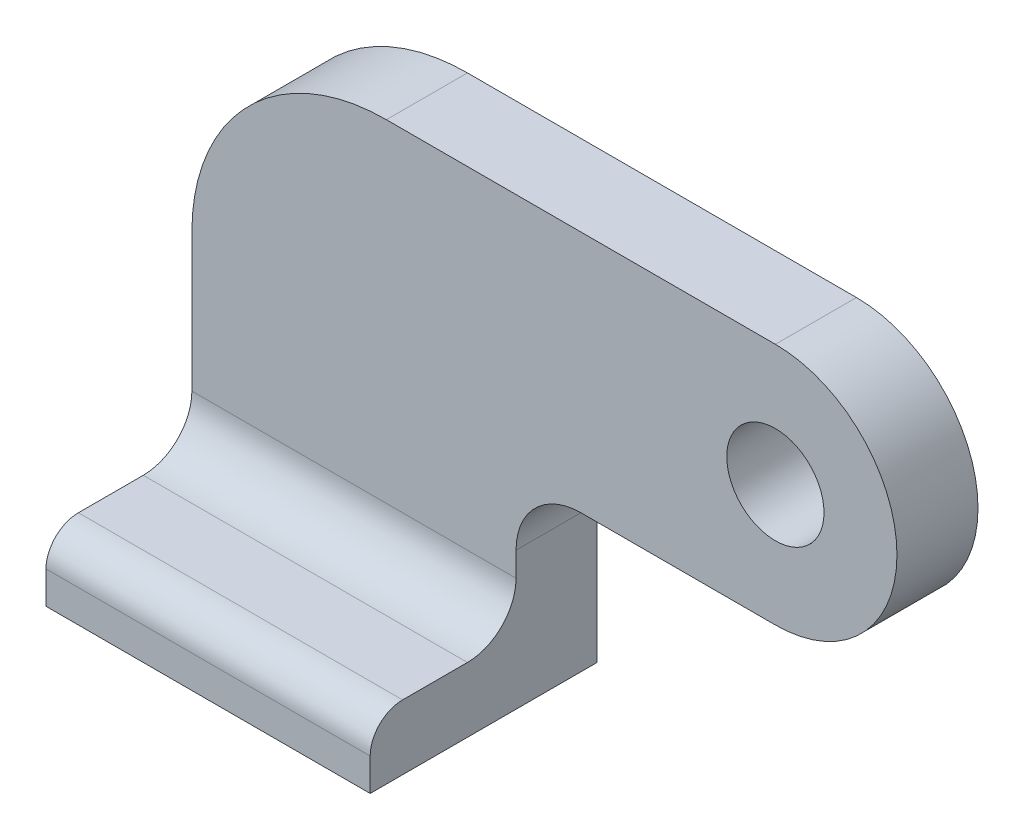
ISO-10303-21;
HEADER;
FILE_DESCRIPTION(('STEP AP214'),'2;1');
FILE_NAME('part.step','',(''),(''),'','','');
FILE_SCHEMA(('AUTOMOTIVE_DESIGN { 1 0 10303 214 1 1 1 1 }'));
ENDSEC;
DATA;
#1=APPLICATION_CONTEXT('core data for automotive mechanical design processes');
#2=APPLICATION_PROTOCOL_DEFINITION('international standard','automotive_design',2000,#1);
#3=PRODUCT_CONTEXT('',#1,'mechanical');
#4=PRODUCT('Part','Part','',(#3));
#5=PRODUCT_RELATED_PRODUCT_CATEGORY('part','',(#4));
#6=PRODUCT_DEFINITION_FORMATION('','',#4);
#7=PRODUCT_DEFINITION_CONTEXT('part definition',#1,'design');
#8=PRODUCT_DEFINITION('design','',#6,#7);
#9=PRODUCT_DEFINITION_SHAPE('','',#8);
#10=(LENGTH_UNIT() NAMED_UNIT(*) SI_UNIT(.MILLI.,.METRE.));
#11=(NAMED_UNIT(*) PLANE_ANGLE_UNIT() SI_UNIT($,.RADIAN.));
#12=(NAMED_UNIT(*) SI_UNIT($,.STERADIAN.) SOLID_ANGLE_UNIT());
#13=UNCERTAINTY_MEASURE_WITH_UNIT(LENGTH_MEASURE(1.E-05),#10,'distance_accuracy_value','');
#14=(GEOMETRIC_REPRESENTATION_CONTEXT(3) GLOBAL_UNCERTAINTY_ASSIGNED_CONTEXT((#13)) GLOBAL_UNIT_ASSIGNED_CONTEXT((#10,
#11,#12)) REPRESENTATION_CONTEXT('',''));
#15=CARTESIAN_POINT('',(0.,0.,0.));
#16=DIRECTION('',(0.,0.,1.));
#17=DIRECTION('',(1.,0.,0.));
#18=AXIS2_PLACEMENT_3D('',#15,#16,#17);
#19=CARTESIAN_POINT('',(0.,0.,-15.875));
#20=DIRECTION('',(-1.,0.,0.));
#21=DIRECTION('',(0.,0.,1.));
#22=AXIS2_PLACEMENT_3D('',#19,#20,#21);
#23=PLANE('',#22);
#24=DIRECTION('',(0.,1.,0.));
#25=VECTOR('',#24,1.);
#26=CARTESIAN_POINT('',(0.,0.,28.575));
#27=LINE('',#26,#25);
#28=CARTESIAN_POINT('',(0.,0.,28.575));
#29=VERTEX_POINT('',#28);
#30=CARTESIAN_POINT('',(0.,6.35,28.575));
#31=VERTEX_POINT('',#30);
#32=EDGE_CURVE('E130',#29,#31,#27,.T.);
#33=ORIENTED_EDGE('',*,*,#32,.T.);
#34=CARTESIAN_POINT('',(0.,6.35,22.225));
#35=DIRECTION('',(-1.,0.,0.));
#36=DIRECTION('',(0.,0.,1.));
#37=AXIS2_PLACEMENT_3D('',#34,#35,#36);
#38=CIRCLE('',#37,6.35);
#39=CARTESIAN_POINT('',(0.,12.7,22.225));
#40=VERTEX_POINT('',#39);
#41=EDGE_CURVE('E217',#31,#40,#38,.T.);
#42=ORIENTED_EDGE('',*,*,#41,.T.);
#43=DIRECTION('',(0.,0.,-1.));
#44=VECTOR('',#43,1.);
#45=CARTESIAN_POINT('',(0.,12.7,28.575));
#46=LINE('',#45,#44);
#47=CARTESIAN_POINT('',(0.,12.7,9.525));
#48=VERTEX_POINT('',#47);
#49=EDGE_CURVE('E145',#40,#48,#46,.T.);
#50=ORIENTED_EDGE('',*,*,#49,.T.);
#51=CARTESIAN_POINT('',(0.,22.225,9.525));
#52=DIRECTION('',(-1.,0.,0.));
#53=DIRECTION('',(0.,0.,1.));
#54=AXIS2_PLACEMENT_3D('',#51,#52,#53);
#55=CIRCLE('',#54,9.525);
#56=CARTESIAN_POINT('',(0.,22.225,0.));
#57=VERTEX_POINT('',#56);
#58=EDGE_CURVE('E40',#48,#57,#55,.F.);
#59=ORIENTED_EDGE('',*,*,#58,.T.);
#60=DIRECTION('',(0.,-1.,0.));
#61=VECTOR('',#60,1.);
#62=CARTESIAN_POINT('',(0.,0.,0.));
#63=LINE('',#62,#61);
#64=CARTESIAN_POINT('',(0.,49.2125,0.));
#65=VERTEX_POINT('',#64);
#66=EDGE_CURVE('E157',#65,#57,#63,.T.);
#67=ORIENTED_EDGE('',*,*,#66,.F.);
#68=DIRECTION('',(0.,0.,1.));
#69=VECTOR('',#68,1.);
#70=CARTESIAN_POINT('',(0.,49.2125,-15.875));
#71=LINE('',#70,#69);
#72=CARTESIAN_POINT('',(0.,49.2125,-15.875));
#73=VERTEX_POINT('',#72);
#74=EDGE_CURVE('E198',#73,#65,#71,.T.);
#75=ORIENTED_EDGE('',*,*,#74,.F.);
#76=DIRECTION('',(0.,-1.,0.));
#77=VECTOR('',#76,1.);
#78=CARTESIAN_POINT('',(0.,0.,-15.875));
#79=LINE('',#78,#77);
#80=CARTESIAN_POINT('',(0.,0.,-15.875));
#81=VERTEX_POINT('',#80);
#82=EDGE_CURVE('E160',#73,#81,#79,.T.);
#83=ORIENTED_EDGE('',*,*,#82,.T.);
#84=DIRECTION('',(0.,0.,1.));
#85=VECTOR('',#84,1.);
#86=CARTESIAN_POINT('',(0.,0.,-15.875));
#87=LINE('',#86,#85);
#88=EDGE_CURVE('E140',#81,#29,#87,.T.);
#89=ORIENTED_EDGE('',*,*,#88,.T.);
#90=EDGE_LOOP('',(#33,#42,#50,#59,#67,#75,#83,#89));
#91=FACE_BOUND('',#90,.T.);
#92=ADVANCED_FACE('F32',(#91),#23,.T.);
#93=CARTESIAN_POINT('',(38.1,49.2125,-15.875));
#94=DIRECTION('',(0.,0.,1.));
#95=DIRECTION('',(1.,0.,0.));
#96=AXIS2_PLACEMENT_3D('',#93,#94,#95);
#97=CYLINDRICAL_SURFACE('',#96,38.1);
#98=CARTESIAN_POINT('',(38.1,49.2125,0.));
#99=DIRECTION('',(0.,0.,1.));
#100=DIRECTION('',(1.,0.,0.));
#101=AXIS2_PLACEMENT_3D('',#98,#99,#100);
#102=CIRCLE('',#101,38.1);
#103=CARTESIAN_POINT('',(38.1,87.3125,0.));
#104=VERTEX_POINT('',#103);
#105=EDGE_CURVE('E162',#104,#65,#102,.T.);
#106=ORIENTED_EDGE('',*,*,#105,.F.);
#107=DIRECTION('',(0.,0.,1.));
#108=VECTOR('',#107,1.);
#109=CARTESIAN_POINT('',(38.1,87.3125,-15.875));
#110=LINE('',#109,#108);
#111=CARTESIAN_POINT('',(38.1,87.3125,-15.875));
#112=VERTEX_POINT('',#111);
#113=EDGE_CURVE('E201',#112,#104,#110,.T.);
#114=ORIENTED_EDGE('',*,*,#113,.F.);
#115=CARTESIAN_POINT('',(38.1,49.2125,-15.875));
#116=DIRECTION('',(0.,0.,1.));
#117=DIRECTION('',(1.,0.,0.));
#118=AXIS2_PLACEMENT_3D('',#115,#116,#117);
#119=CIRCLE('',#118,38.1);
#120=EDGE_CURVE('E178',#112,#73,#119,.T.);
#121=ORIENTED_EDGE('',*,*,#120,.T.);
#122=ORIENTED_EDGE('',*,*,#74,.T.);
#123=EDGE_LOOP('',(#106,#114,#121,#122));
#124=FACE_BOUND('',#123,.T.);
#125=ADVANCED_FACE('F237',(#124),#97,.T.);
#126=CARTESIAN_POINT('',(38.1,87.3125,-15.875));
#127=DIRECTION('',(0.,1.,0.));
#128=DIRECTION('',(0.,0.,1.));
#129=AXIS2_PLACEMENT_3D('',#126,#127,#128);
#130=PLANE('',#129);
#131=DIRECTION('',(-1.,0.,0.));
#132=VECTOR('',#131,1.);
#133=CARTESIAN_POINT('',(38.1,87.3125,0.));
#134=LINE('',#133,#132);
#135=CARTESIAN_POINT('',(114.3,87.3125,0.));
#136=VERTEX_POINT('',#135);
#137=EDGE_CURVE('E193',#136,#104,#134,.T.);
#138=ORIENTED_EDGE('',*,*,#137,.F.);
#139=DIRECTION('',(0.,0.,1.));
#140=VECTOR('',#139,1.);
#141=CARTESIAN_POINT('',(114.3,87.3125,-15.875));
#142=LINE('',#141,#140);
#143=CARTESIAN_POINT('',(114.3,87.3125,-15.875));
#144=VERTEX_POINT('',#143);
#145=EDGE_CURVE('E203',#144,#136,#142,.T.);
#146=ORIENTED_EDGE('',*,*,#145,.F.);
#147=DIRECTION('',(-1.,0.,0.));
#148=VECTOR('',#147,1.);
#149=CARTESIAN_POINT('',(38.1,87.3125,-15.875));
#150=LINE('',#149,#148);
#151=EDGE_CURVE('E175',#144,#112,#150,.T.);
#152=ORIENTED_EDGE('',*,*,#151,.T.);
#153=ORIENTED_EDGE('',*,*,#113,.T.);
#154=EDGE_LOOP('',(#138,#146,#152,#153));
#155=FACE_BOUND('',#154,.T.);
#156=ADVANCED_FACE('F242',(#155),#130,.T.);
#157=CARTESIAN_POINT('',(114.3,63.5,-15.875));
#158=DIRECTION('',(0.,0.,1.));
#159=DIRECTION('',(1.,0.,0.));
#160=AXIS2_PLACEMENT_3D('',#157,#158,#159);
#161=CYLINDRICAL_SURFACE('',#160,23.8125);
#162=CARTESIAN_POINT('',(114.3,63.5,0.));
#163=DIRECTION('',(0.,0.,1.));
#164=DIRECTION('',(-1.,0.,0.));
#165=AXIS2_PLACEMENT_3D('',#162,#163,#164);
#166=CIRCLE('',#165,23.8125);
#167=CARTESIAN_POINT('',(114.3,39.6875,0.));
#168=VERTEX_POINT('',#167);
#169=EDGE_CURVE('E190',#168,#136,#166,.T.);
#170=ORIENTED_EDGE('',*,*,#169,.F.);
#171=DIRECTION('',(0.,0.,1.));
#172=VECTOR('',#171,1.);
#173=CARTESIAN_POINT('',(114.3,39.6875,-15.875));
#174=LINE('',#173,#172);
#175=CARTESIAN_POINT('',(114.3,39.6875,-15.875));
#176=VERTEX_POINT('',#175);
#177=EDGE_CURVE('E205',#176,#168,#174,.T.);
#178=ORIENTED_EDGE('',*,*,#177,.F.);
#179=CARTESIAN_POINT('',(114.3,63.5,-15.875));
#180=DIRECTION('',(0.,0.,1.));
#181=DIRECTION('',(-1.,0.,0.));
#182=AXIS2_PLACEMENT_3D('',#179,#180,#181);
#183=CIRCLE('',#182,23.8125);
#184=EDGE_CURVE('E172',#176,#144,#183,.T.);
#185=ORIENTED_EDGE('',*,*,#184,.T.);
#186=ORIENTED_EDGE('',*,*,#145,.T.);
#187=EDGE_LOOP('',(#170,#178,#185,#186));
#188=FACE_BOUND('',#187,.T.);
#189=ADVANCED_FACE('F258',(#188),#161,.T.);
#190=CARTESIAN_POINT('',(76.2,39.6875,-15.875));
#191=DIRECTION('',(0.,-1.,0.));
#192=DIRECTION('',(0.,0.,-1.));
#193=AXIS2_PLACEMENT_3D('',#190,#191,#192);
#194=PLANE('',#193);
#195=DIRECTION('',(1.,0.,0.));
#196=VECTOR('',#195,1.);
#197=CARTESIAN_POINT('',(76.2,39.6875,0.));
#198=LINE('',#197,#196);
#199=CARTESIAN_POINT('',(76.2,39.6875,0.));
#200=VERTEX_POINT('',#199);
#201=EDGE_CURVE('E187',#200,#168,#198,.T.);
#202=ORIENTED_EDGE('',*,*,#201,.F.);
#203=DIRECTION('',(0.,0.,1.));
#204=VECTOR('',#203,1.);
#205=CARTESIAN_POINT('',(76.2,39.6875,-15.875));
#206=LINE('',#205,#204);
#207=CARTESIAN_POINT('',(76.2,39.6875,-15.875));
#208=VERTEX_POINT('',#207);
#209=EDGE_CURVE('E207',#208,#200,#206,.T.);
#210=ORIENTED_EDGE('',*,*,#209,.F.);
#211=DIRECTION('',(1.,0.,0.));
#212=VECTOR('',#211,1.);
#213=CARTESIAN_POINT('',(76.2,39.6875,-15.875));
#214=LINE('',#213,#212);
#215=EDGE_CURVE('E169',#208,#176,#214,.T.);
#216=ORIENTED_EDGE('',*,*,#215,.T.);
#217=ORIENTED_EDGE('',*,*,#177,.T.);
#218=EDGE_LOOP('',(#202,#210,#216,#217));
#219=FACE_BOUND('',#218,.T.);
#220=ADVANCED_FACE('F254',(#219),#194,.T.);
#221=CARTESIAN_POINT('',(76.2,26.9875,-15.875));
#222=DIRECTION('',(0.,0.,1.));
#223=DIRECTION('',(1.,0.,0.));
#224=AXIS2_PLACEMENT_3D('',#221,#222,#223);
#225=CYLINDRICAL_SURFACE('',#224,12.7);
#226=CARTESIAN_POINT('',(76.2,26.9875,0.));
#227=DIRECTION('',(0.,0.,-1.));
#228=DIRECTION('',(-1.,0.,0.));
#229=AXIS2_PLACEMENT_3D('',#226,#227,#228);
#230=CIRCLE('',#229,12.7);
#231=CARTESIAN_POINT('',(63.5,26.9875,0.));
#232=VERTEX_POINT('',#231);
#233=EDGE_CURVE('E184',#232,#200,#230,.T.);
#234=ORIENTED_EDGE('',*,*,#233,.F.);
#235=DIRECTION('',(0.,0.,1.));
#236=VECTOR('',#235,1.);
#237=CARTESIAN_POINT('',(63.5,26.9875,-15.875));
#238=LINE('',#237,#236);
#239=CARTESIAN_POINT('',(63.5,26.9875,-15.875));
#240=VERTEX_POINT('',#239);
#241=EDGE_CURVE('E139',#240,#232,#238,.T.);
#242=ORIENTED_EDGE('',*,*,#241,.F.);
#243=CARTESIAN_POINT('',(76.2,26.9875,-15.875));
#244=DIRECTION('',(0.,0.,-1.));
#245=DIRECTION('',(-1.,0.,0.));
#246=AXIS2_PLACEMENT_3D('',#243,#244,#245);
#247=CIRCLE('',#246,12.7);
#248=EDGE_CURVE('E166',#240,#208,#247,.T.);
#249=ORIENTED_EDGE('',*,*,#248,.T.);
#250=ORIENTED_EDGE('',*,*,#209,.T.);
#251=EDGE_LOOP('',(#234,#242,#249,#250));
#252=FACE_BOUND('',#251,.T.);
#253=ADVANCED_FACE('F251',(#252),#225,.F.);
#254=CARTESIAN_POINT('',(63.5,26.9875,-15.875));
#255=DIRECTION('',(1.,0.,0.));
#256=DIRECTION('',(0.,0.,-1.));
#257=AXIS2_PLACEMENT_3D('',#254,#255,#256);
#258=PLANE('',#257);
#259=DIRECTION('',(0.,0.,-1.));
#260=VECTOR('',#259,1.);
#261=CARTESIAN_POINT('',(63.5,12.7,28.575));
#262=LINE('',#261,#260);
#263=CARTESIAN_POINT('',(63.5,12.7,22.225));
#264=VERTEX_POINT('',#263);
#265=CARTESIAN_POINT('',(63.5,12.7,9.525));
#266=VERTEX_POINT('',#265);
#267=EDGE_CURVE('E147',#264,#266,#262,.T.);
#268=ORIENTED_EDGE('',*,*,#267,.F.);
#269=CARTESIAN_POINT('',(63.5,6.34999999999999,22.225));
#270=DIRECTION('',(1.,0.,0.));
#271=DIRECTION('',(0.,0.,-1.));
#272=AXIS2_PLACEMENT_3D('',#269,#270,#271);
#273=CIRCLE('',#272,6.35);
#274=CARTESIAN_POINT('',(63.5,6.34999999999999,28.575));
#275=VERTEX_POINT('',#274);
#276=EDGE_CURVE('E125',#264,#275,#273,.T.);
#277=ORIENTED_EDGE('',*,*,#276,.T.);
#278=DIRECTION('',(0.,-1.,0.));
#279=VECTOR('',#278,1.);
#280=CARTESIAN_POINT('',(63.5,0.,28.575));
#281=LINE('',#280,#279);
#282=CARTESIAN_POINT('',(63.5,0.,28.575));
#283=VERTEX_POINT('',#282);
#284=EDGE_CURVE('E119',#275,#283,#281,.T.);
#285=ORIENTED_EDGE('',*,*,#284,.T.);
#286=DIRECTION('',(0.,0.,1.));
#287=VECTOR('',#286,1.);
#288=CARTESIAN_POINT('',(63.5,0.,-15.875));
#289=LINE('',#288,#287);
#290=CARTESIAN_POINT('',(63.5,0.,-15.875));
#291=VERTEX_POINT('',#290);
#292=EDGE_CURVE('E123',#291,#283,#289,.T.);
#293=ORIENTED_EDGE('',*,*,#292,.F.);
#294=DIRECTION('',(0.,1.,0.));
#295=VECTOR('',#294,1.);
#296=CARTESIAN_POINT('',(63.5,26.9875,-15.875));
#297=LINE('',#296,#295);
#298=EDGE_CURVE('E164',#291,#240,#297,.T.);
#299=ORIENTED_EDGE('',*,*,#298,.T.);
#300=ORIENTED_EDGE('',*,*,#241,.T.);
#301=DIRECTION('',(0.,1.,0.));
#302=VECTOR('',#301,1.);
#303=CARTESIAN_POINT('',(63.5,26.9875,0.));
#304=LINE('',#303,#302);
#305=CARTESIAN_POINT('',(63.5,22.225,0.));
#306=VERTEX_POINT('',#305);
#307=EDGE_CURVE('E182',#306,#232,#304,.T.);
#308=ORIENTED_EDGE('',*,*,#307,.F.);
#309=CARTESIAN_POINT('',(63.5,22.225,9.525));
#310=DIRECTION('',(1.,0.,0.));
#311=DIRECTION('',(0.,0.,-1.));
#312=AXIS2_PLACEMENT_3D('',#309,#310,#311);
#313=CIRCLE('',#312,9.525);
#314=EDGE_CURVE('E11',#306,#266,#313,.F.);
#315=ORIENTED_EDGE('',*,*,#314,.T.);
#316=EDGE_LOOP('',(#268,#277,#285,#293,#299,#300,#308,#315));
#317=FACE_BOUND('',#316,.T.);
#318=ADVANCED_FACE('F122',(#317),#258,.T.);
#319=CARTESIAN_POINT('',(0.,0.,-15.875));
#320=DIRECTION('',(0.,-1.,0.));
#321=DIRECTION('',(0.,0.,-1.));
#322=AXIS2_PLACEMENT_3D('',#319,#320,#321);
#323=PLANE('',#322);
#324=ORIENTED_EDGE('',*,*,#292,.T.);
#325=DIRECTION('',(-1.,0.,0.));
#326=VECTOR('',#325,1.);
#327=CARTESIAN_POINT('',(0.,0.,28.575));
#328=LINE('',#327,#326);
#329=EDGE_CURVE('E129',#283,#29,#328,.T.);
#330=ORIENTED_EDGE('',*,*,#329,.T.);
#331=ORIENTED_EDGE('',*,*,#88,.F.);
#332=DIRECTION('',(1.,0.,0.));
#333=VECTOR('',#332,1.);
#334=CARTESIAN_POINT('',(0.,0.,-15.875));
#335=LINE('',#334,#333);
#336=EDGE_CURVE('E138',#81,#291,#335,.T.);
#337=ORIENTED_EDGE('',*,*,#336,.T.);
#338=EDGE_LOOP('',(#324,#330,#331,#337));
#339=FACE_BOUND('',#338,.T.);
#340=ADVANCED_FACE('F135',(#339),#323,.T.);
#341=CARTESIAN_POINT('',(38.1,49.2125,-15.875));
#342=DIRECTION('',(0.,0.,1.));
#343=DIRECTION('',(1.,0.,0.));
#344=AXIS2_PLACEMENT_3D('',#341,#342,#343);
#345=PLANE('',#344);
#346=CARTESIAN_POINT('',(114.3,63.5,-15.875));
#347=DIRECTION('',(0.,0.,1.));
#348=DIRECTION('',(1.,0.,0.));
#349=AXIS2_PLACEMENT_3D('',#346,#347,#348);
#350=CIRCLE('',#349,9.525);
#351=CARTESIAN_POINT('',(123.825,63.5,-15.875));
#352=VERTEX_POINT('',#351);
#353=EDGE_CURVE('E154',#352,#352,#350,.T.);
#354=ORIENTED_EDGE('',*,*,#353,.T.);
#355=EDGE_LOOP('',(#354));
#356=FACE_BOUND('',#355,.T.);
#357=ORIENTED_EDGE('',*,*,#248,.F.);
#358=ORIENTED_EDGE('',*,*,#298,.F.);
#359=ORIENTED_EDGE('',*,*,#336,.F.);
#360=ORIENTED_EDGE('',*,*,#82,.F.);
#361=ORIENTED_EDGE('',*,*,#120,.F.);
#362=ORIENTED_EDGE('',*,*,#151,.F.);
#363=ORIENTED_EDGE('',*,*,#184,.F.);
#364=ORIENTED_EDGE('',*,*,#215,.F.);
#365=EDGE_LOOP('',(#357,#358,#359,#360,#361,#362,#363,#364));
#366=FACE_BOUND('',#365,.T.);
#367=ADVANCED_FACE('F248',(#356,#366),#345,.F.);
#368=CARTESIAN_POINT('',(38.1,49.2125,0.));
#369=DIRECTION('',(0.,0.,1.));
#370=DIRECTION('',(1.,0.,0.));
#371=AXIS2_PLACEMENT_3D('',#368,#369,#370);
#372=PLANE('',#371);
#373=ORIENTED_EDGE('',*,*,#66,.T.);
#374=DIRECTION('',(-1.,0.,0.));
#375=VECTOR('',#374,1.);
#376=CARTESIAN_POINT('',(63.5,22.225,0.));
#377=LINE('',#376,#375);
#378=EDGE_CURVE('E53',#57,#306,#377,.F.);
#379=ORIENTED_EDGE('',*,*,#378,.T.);
#380=ORIENTED_EDGE('',*,*,#307,.T.);
#381=ORIENTED_EDGE('',*,*,#233,.T.);
#382=ORIENTED_EDGE('',*,*,#201,.T.);
#383=ORIENTED_EDGE('',*,*,#169,.T.);
#384=ORIENTED_EDGE('',*,*,#137,.T.);
#385=ORIENTED_EDGE('',*,*,#105,.T.);
#386=EDGE_LOOP('',(#373,#379,#380,#381,#382,#383,#384,#385));
#387=FACE_BOUND('',#386,.T.);
#388=CARTESIAN_POINT('',(114.3,63.5,0.));
#389=DIRECTION('',(0.,0.,1.));
#390=DIRECTION('',(1.,0.,0.));
#391=AXIS2_PLACEMENT_3D('',#388,#389,#390);
#392=CIRCLE('',#391,9.525);
#393=CARTESIAN_POINT('',(123.825,63.5,0.));
#394=VERTEX_POINT('',#393);
#395=EDGE_CURVE('E152',#394,#394,#392,.T.);
#396=ORIENTED_EDGE('',*,*,#395,.F.);
#397=EDGE_LOOP('',(#396));
#398=FACE_BOUND('',#397,.T.);
#399=ADVANCED_FACE('F266',(#387,#398),#372,.T.);
#400=CARTESIAN_POINT('',(114.3,63.5,-15.875));
#401=DIRECTION('',(0.,0.,1.));
#402=DIRECTION('',(1.,0.,0.));
#403=AXIS2_PLACEMENT_3D('',#400,#401,#402);
#404=CYLINDRICAL_SURFACE('',#403,9.525);
#405=ORIENTED_EDGE('',*,*,#353,.F.);
#406=EDGE_LOOP('',(#405));
#407=FACE_BOUND('',#406,.T.);
#408=ORIENTED_EDGE('',*,*,#395,.T.);
#409=EDGE_LOOP('',(#408));
#410=FACE_BOUND('',#409,.T.);
#411=ADVANCED_FACE('F269',(#407,#410),#404,.F.);
#412=CARTESIAN_POINT('',(0.,12.7,28.575));
#413=DIRECTION('',(0.,1.,0.));
#414=DIRECTION('',(-1.,0.,0.));
#415=AXIS2_PLACEMENT_3D('',#412,#413,#414);
#416=PLANE('',#415);
#417=ORIENTED_EDGE('',*,*,#267,.T.);
#418=DIRECTION('',(-1.,0.,0.));
#419=VECTOR('',#418,1.);
#420=CARTESIAN_POINT('',(0.,12.7,9.525));
#421=LINE('',#420,#419);
#422=EDGE_CURVE('E219',#266,#48,#421,.T.);
#423=ORIENTED_EDGE('',*,*,#422,.T.);
#424=ORIENTED_EDGE('',*,*,#49,.F.);
#425=DIRECTION('',(1.,0.,0.));
#426=VECTOR('',#425,1.);
#427=CARTESIAN_POINT('',(63.5,12.7,22.225));
#428=LINE('',#427,#426);
#429=EDGE_CURVE('E200',#40,#264,#428,.T.);
#430=ORIENTED_EDGE('',*,*,#429,.T.);
#431=EDGE_LOOP('',(#417,#423,#424,#430));
#432=FACE_BOUND('',#431,.T.);
#433=ADVANCED_FACE('F225',(#432),#416,.T.);
#434=CARTESIAN_POINT('',(0.,12.7,28.575));
#435=DIRECTION('',(0.,0.,-1.));
#436=DIRECTION('',(-1.,0.,0.));
#437=AXIS2_PLACEMENT_3D('',#434,#435,#436);
#438=PLANE('',#437);
#439=ORIENTED_EDGE('',*,*,#284,.F.);
#440=DIRECTION('',(1.,0.,0.));
#441=VECTOR('',#440,1.);
#442=CARTESIAN_POINT('',(0.,6.35,28.575));
#443=LINE('',#442,#441);
#444=EDGE_CURVE('E215',#275,#31,#443,.F.);
#445=ORIENTED_EDGE('',*,*,#444,.T.);
#446=ORIENTED_EDGE('',*,*,#32,.F.);
#447=ORIENTED_EDGE('',*,*,#329,.F.);
#448=EDGE_LOOP('',(#439,#445,#446,#447));
#449=FACE_BOUND('',#448,.T.);
#450=ADVANCED_FACE('F143',(#449),#438,.F.);
#451=CARTESIAN_POINT('',(0.,6.35,22.225));
#452=DIRECTION('',(-1.,0.,0.));
#453=DIRECTION('',(0.,-1.,0.));
#454=AXIS2_PLACEMENT_3D('',#451,#452,#453);
#455=CYLINDRICAL_SURFACE('',#454,6.35);
#456=ORIENTED_EDGE('',*,*,#41,.F.);
#457=ORIENTED_EDGE('',*,*,#444,.F.);
#458=ORIENTED_EDGE('',*,*,#276,.F.);
#459=ORIENTED_EDGE('',*,*,#429,.F.);
#460=EDGE_LOOP('',(#456,#457,#458,#459));
#461=FACE_BOUND('',#460,.T.);
#462=ADVANCED_FACE('F231',(#461),#455,.T.);
#463=CARTESIAN_POINT('',(0.,22.225,9.525));
#464=DIRECTION('',(1.,0.,0.));
#465=DIRECTION('',(0.,1.,0.));
#466=AXIS2_PLACEMENT_3D('',#463,#464,#465);
#467=CYLINDRICAL_SURFACE('',#466,9.525);
#468=ORIENTED_EDGE('',*,*,#314,.F.);
#469=ORIENTED_EDGE('',*,*,#378,.F.);
#470=ORIENTED_EDGE('',*,*,#58,.F.);
#471=ORIENTED_EDGE('',*,*,#422,.F.);
#472=EDGE_LOOP('',(#468,#469,#470,#471));
#473=FACE_BOUND('',#472,.T.);
#474=ADVANCED_FACE('F34',(#473),#467,.F.);
#475=CLOSED_SHELL('',(#92,#125,#156,#189,#220,#253,#318,#340,#367,#399,#411,#433,#450,#462,#474));
#476=MANIFOLD_SOLID_BREP('B2',#475);
#477=ADVANCED_BREP_SHAPE_REPRESENTATION('',(#18,#476),#14);
#478=SHAPE_DEFINITION_REPRESENTATION(#9,#477);
ENDSEC;
END-ISO-10303-21;
